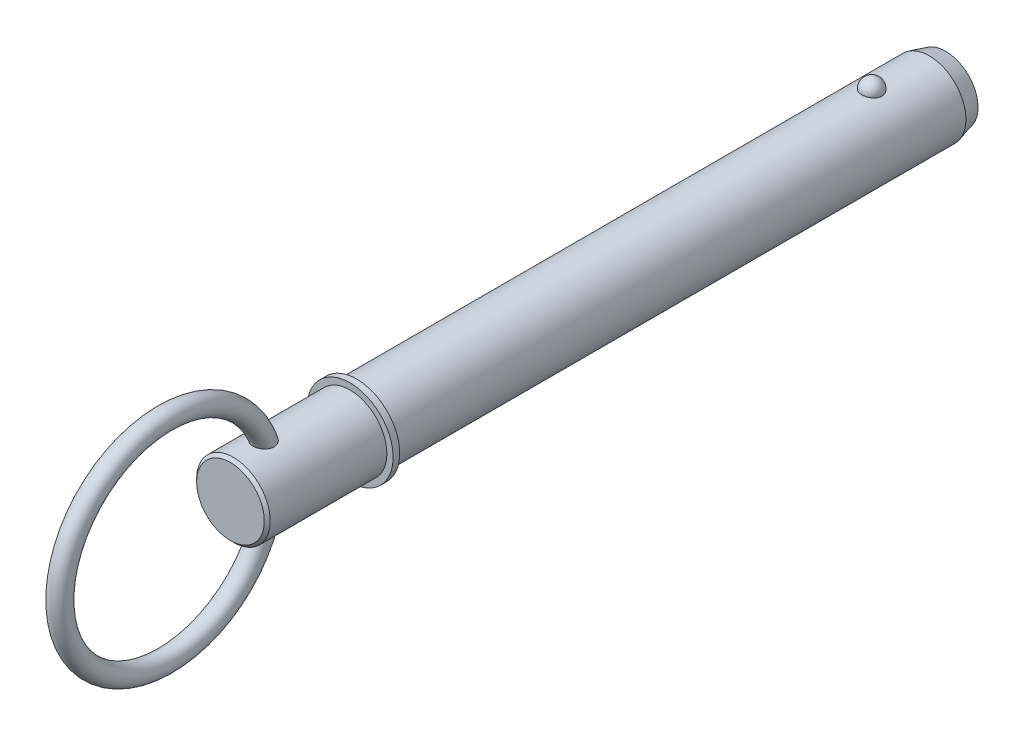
from build123d import *

# Parameters (mm, degrees)
SKETCH2_R           = 11.115
BOSS_EXTRUDE1_DEPTH = 152.4
BOSS_EXTRUDE2_START = 25.4
SKETCH3_R           = 11.115
BOSS_EXTRUDE2_DEPTH = 25.4
CHAMFER1_SIZE       = 5
CHAMFER1_SIZE2      = 1.339745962
SKETCH20_W          = 2
SKETCH20_H          = 13
SKETCH21_R          = 11.115
BOSS_EXTRUDE3_DEPTH = 38.1
CHAMFER2_SIZE       = 0.9
SKETCH24_R          = 3


with BuildPart() as part:
    # Sketch2 → Boss-Extrude1 (new body)
    with BuildSketch(Plane.XY):
        with Locations(Location((0, 0, 0), (0, 0, 180))):
            Circle(SKETCH2_R)
    extrude(amount=BOSS_EXTRUDE1_DEPTH)

    # Sketch3 → Boss-Extrude2 (add)
    with BuildSketch(Plane(origin=(0, 0, 0), x_dir=(-1, 0, 0), z_dir=(0, 0, -1)).offset(BOSS_EXTRUDE2_START)):
        Circle(SKETCH3_R)
    extrude(amount=-BOSS_EXTRUDE2_DEPTH)

    # Chamfer1
    chamfer1_edges = [part.edges().sort_by_distance(p)[0] for p in [
        (11.115, 0, -25.4),
    ]]
    chamfer1_side = [part.faces().sort_by_distance(p)[0] for p in [
        (11.115, 0, 63.5),
    ]]
    chamfer(chamfer1_edges, length=CHAMFER1_SIZE, length2=CHAMFER1_SIZE2, reference=chamfer1_side[0])

    # Sketch18 → Revolve1 (revolve)
    with BuildSketch(Plane(origin=(0, 0, 0), x_dir=(0, 0, -1), z_dir=(1, 0, 0))):
        with BuildLine():
            Line((3.07, 14.185), (3.07, 8.045))
            ThreePointArc((3.07, 8.045), (0, 11.115), (3.07, 14.185))
        make_face()
    revolve(axis=Axis((0, 14.185, -3.07), (0, -1, 0)))

    # Sketch20 → Revolve2 (revolve)
    with BuildSketch(Plane(origin=(0, 0, 0), x_dir=(0, 0, -1), z_dir=(1, 0, 0)), mode=Mode.PRIVATE) as revolve2_sk:
        with Locations((-153.4, 6.5)):
            Rectangle(SKETCH20_W, SKETCH20_H)
    revolve(revolve2_sk.sketch.rotate(Axis((0, 0, 33.728787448), (0, 0, 1)), 90), axis=Axis((0, 0, 33.728787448), (0, 0, 1)))

    # Sketch21 → Boss-Extrude3 (add)
    with BuildSketch(Plane(origin=(0, 0, 152.4), x_dir=(-1, 0, 0), z_dir=(0, 0, -1))):
        Circle(SKETCH21_R)
    extrude(amount=-BOSS_EXTRUDE3_DEPTH)

    # Chamfer2
    chamfer2_edges = [part.edges().sort_by_distance(p)[0] for p in [
        (11.115, 0, 190.5),
    ]]
    chamfer(chamfer2_edges, length=CHAMFER2_SIZE)

    # Sweep1: sweep along a path in Sketch23
    with BuildLine(Plane(origin=(0, 0, 0), x_dir=(0, 0, -1), z_dir=(1, 0, 0))) as sweep1_path:
        CenterArc((-210.25, 0), 31.75, 0, 360)
    # Sketch24 → Sweep1 (sweep)
    with BuildSketch(Plane(origin=(0, 0, 0), x_dir=(1, 0, 0), z_dir=(0, 1, 0))):
        with Locations((0, -178.5)):
            Circle(SKETCH24_R)
    sweep(path=sweep1_path.line)


solid = part.part
